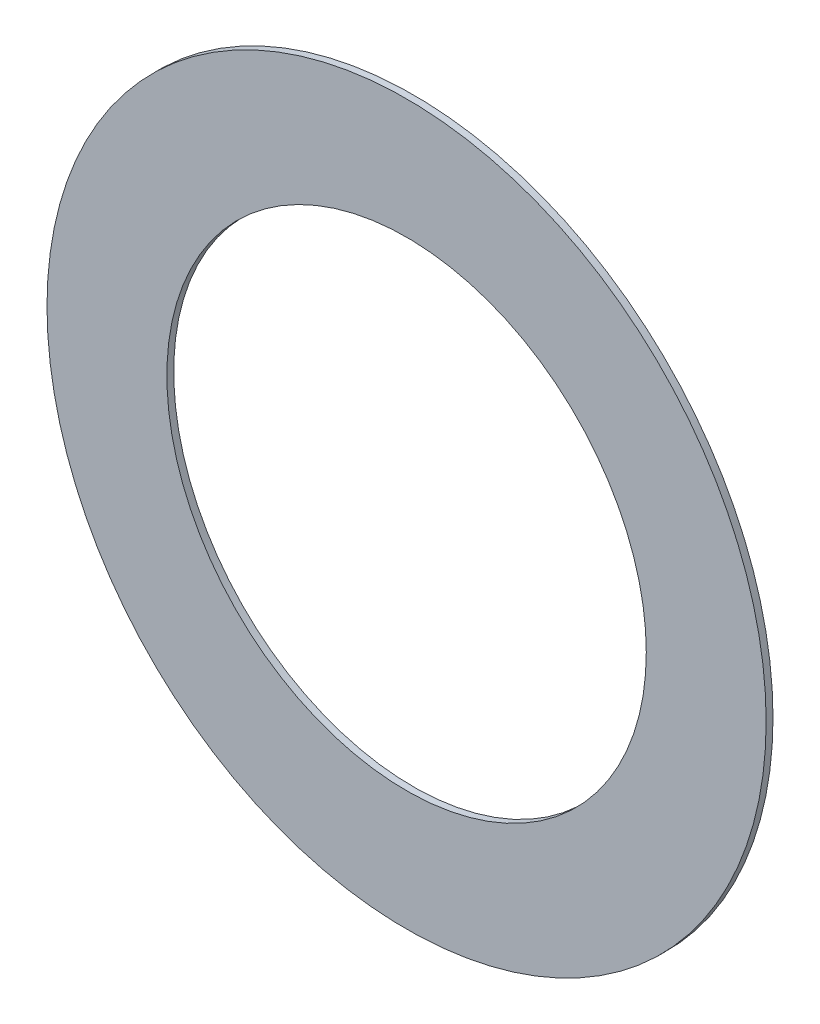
ISO-10303-21;
HEADER;
FILE_DESCRIPTION(('STEP AP214'),'2;1');
FILE_NAME('part.step','',(''),(''),'','','');
FILE_SCHEMA(('AUTOMOTIVE_DESIGN { 1 0 10303 214 1 1 1 1 }'));
ENDSEC;
DATA;
#1=APPLICATION_CONTEXT('core data for automotive mechanical design processes');
#2=APPLICATION_PROTOCOL_DEFINITION('international standard','automotive_design',2000,#1);
#3=PRODUCT_CONTEXT('',#1,'mechanical');
#4=PRODUCT('Part','Part','',(#3));
#5=PRODUCT_RELATED_PRODUCT_CATEGORY('part','',(#4));
#6=PRODUCT_DEFINITION_FORMATION('','',#4);
#7=PRODUCT_DEFINITION_CONTEXT('part definition',#1,'design');
#8=PRODUCT_DEFINITION('design','',#6,#7);
#9=PRODUCT_DEFINITION_SHAPE('','',#8);
#10=(LENGTH_UNIT() NAMED_UNIT(*) SI_UNIT(.MILLI.,.METRE.));
#11=(NAMED_UNIT(*) PLANE_ANGLE_UNIT() SI_UNIT($,.RADIAN.));
#12=(NAMED_UNIT(*) SI_UNIT($,.STERADIAN.) SOLID_ANGLE_UNIT());
#13=UNCERTAINTY_MEASURE_WITH_UNIT(LENGTH_MEASURE(1.E-05),#10,'distance_accuracy_value','');
#14=(GEOMETRIC_REPRESENTATION_CONTEXT(3) GLOBAL_UNCERTAINTY_ASSIGNED_CONTEXT((#13)) GLOBAL_UNIT_ASSIGNED_CONTEXT((#10,
#11,#12)) REPRESENTATION_CONTEXT('',''));
#15=CARTESIAN_POINT('',(0.,0.,0.));
#16=DIRECTION('',(0.,0.,1.));
#17=DIRECTION('',(1.,0.,0.));
#18=AXIS2_PLACEMENT_3D('',#15,#16,#17);
#19=CARTESIAN_POINT('',(0.,0.,0.));
#20=DIRECTION('',(0.,0.,-1.));
#21=DIRECTION('',(-1.,0.,0.));
#22=AXIS2_PLACEMENT_3D('',#19,#20,#21);
#23=CYLINDRICAL_SURFACE('',#22,10.5);
#24=CARTESIAN_POINT('',(0.,0.,0.));
#25=DIRECTION('',(0.,0.,-1.));
#26=DIRECTION('',(1.,0.,0.));
#27=AXIS2_PLACEMENT_3D('',#24,#25,#26);
#28=CIRCLE('',#27,10.5);
#29=CARTESIAN_POINT('',(10.5,0.,0.));
#30=VERTEX_POINT('',#29);
#31=EDGE_CURVE('E10',#30,#30,#28,.T.);
#32=ORIENTED_EDGE('',*,*,#31,.T.);
#33=EDGE_LOOP('',(#32));
#34=FACE_BOUND('',#33,.T.);
#35=CARTESIAN_POINT('',(0.,0.,-0.2));
#36=DIRECTION('',(0.,0.,-1.));
#37=DIRECTION('',(1.,0.,0.));
#38=AXIS2_PLACEMENT_3D('',#35,#36,#37);
#39=CIRCLE('',#38,10.5);
#40=CARTESIAN_POINT('',(10.5,0.,-0.2));
#41=VERTEX_POINT('',#40);
#42=EDGE_CURVE('E354',#41,#41,#39,.T.);
#43=ORIENTED_EDGE('',*,*,#42,.F.);
#44=EDGE_LOOP('',(#43));
#45=FACE_BOUND('',#44,.T.);
#46=ADVANCED_FACE('F348',(#34,#45),#23,.T.);
#47=CARTESIAN_POINT('',(0.,0.,0.));
#48=DIRECTION('',(0.,0.,1.));
#49=DIRECTION('',(1.,0.,0.));
#50=AXIS2_PLACEMENT_3D('',#47,#48,#49);
#51=PLANE('',#50);
#52=CARTESIAN_POINT('',(0.,0.,0.));
#53=DIRECTION('',(0.,0.,-1.));
#54=DIRECTION('',(1.,0.,0.));
#55=AXIS2_PLACEMENT_3D('',#52,#53,#54);
#56=CIRCLE('',#55,7.);
#57=CARTESIAN_POINT('',(7.,0.,0.));
#58=VERTEX_POINT('',#57);
#59=EDGE_CURVE('E358',#58,#58,#56,.T.);
#60=ORIENTED_EDGE('',*,*,#59,.T.);
#61=EDGE_LOOP('',(#60));
#62=FACE_BOUND('',#61,.T.);
#63=ORIENTED_EDGE('',*,*,#31,.F.);
#64=EDGE_LOOP('',(#63));
#65=FACE_BOUND('',#64,.T.);
#66=ADVANCED_FACE('F372',(#62,#65),#51,.T.);
#67=CARTESIAN_POINT('',(0.,0.,-0.2));
#68=DIRECTION('',(0.,0.,1.));
#69=DIRECTION('',(1.,0.,0.));
#70=AXIS2_PLACEMENT_3D('',#67,#68,#69);
#71=PLANE('',#70);
#72=CARTESIAN_POINT('',(0.,0.,-0.2));
#73=DIRECTION('',(0.,0.,-1.));
#74=DIRECTION('',(1.,0.,0.));
#75=AXIS2_PLACEMENT_3D('',#72,#73,#74);
#76=CIRCLE('',#75,7.);
#77=CARTESIAN_POINT('',(7.,0.,-0.2));
#78=VERTEX_POINT('',#77);
#79=EDGE_CURVE('E362',#78,#78,#76,.T.);
#80=ORIENTED_EDGE('',*,*,#79,.F.);
#81=EDGE_LOOP('',(#80));
#82=FACE_BOUND('',#81,.T.);
#83=ORIENTED_EDGE('',*,*,#42,.T.);
#84=EDGE_LOOP('',(#83));
#85=FACE_BOUND('',#84,.T.);
#86=ADVANCED_FACE('F370',(#82,#85),#71,.F.);
#87=CARTESIAN_POINT('',(0.,0.,0.));
#88=DIRECTION('',(0.,0.,-1.));
#89=DIRECTION('',(-1.,0.,0.));
#90=AXIS2_PLACEMENT_3D('',#87,#88,#89);
#91=CYLINDRICAL_SURFACE('',#90,7.);
#92=ORIENTED_EDGE('',*,*,#59,.F.);
#93=EDGE_LOOP('',(#92));
#94=FACE_BOUND('',#93,.T.);
#95=ORIENTED_EDGE('',*,*,#79,.T.);
#96=EDGE_LOOP('',(#95));
#97=FACE_BOUND('',#96,.T.);
#98=ADVANCED_FACE('F368',(#94,#97),#91,.F.);
#99=CLOSED_SHELL('',(#46,#66,#86,#98));
#100=MANIFOLD_SOLID_BREP('B2',#99);
#101=ADVANCED_BREP_SHAPE_REPRESENTATION('',(#18,#100),#14);
#102=SHAPE_DEFINITION_REPRESENTATION(#9,#101);
ENDSEC;
END-ISO-10303-21;
